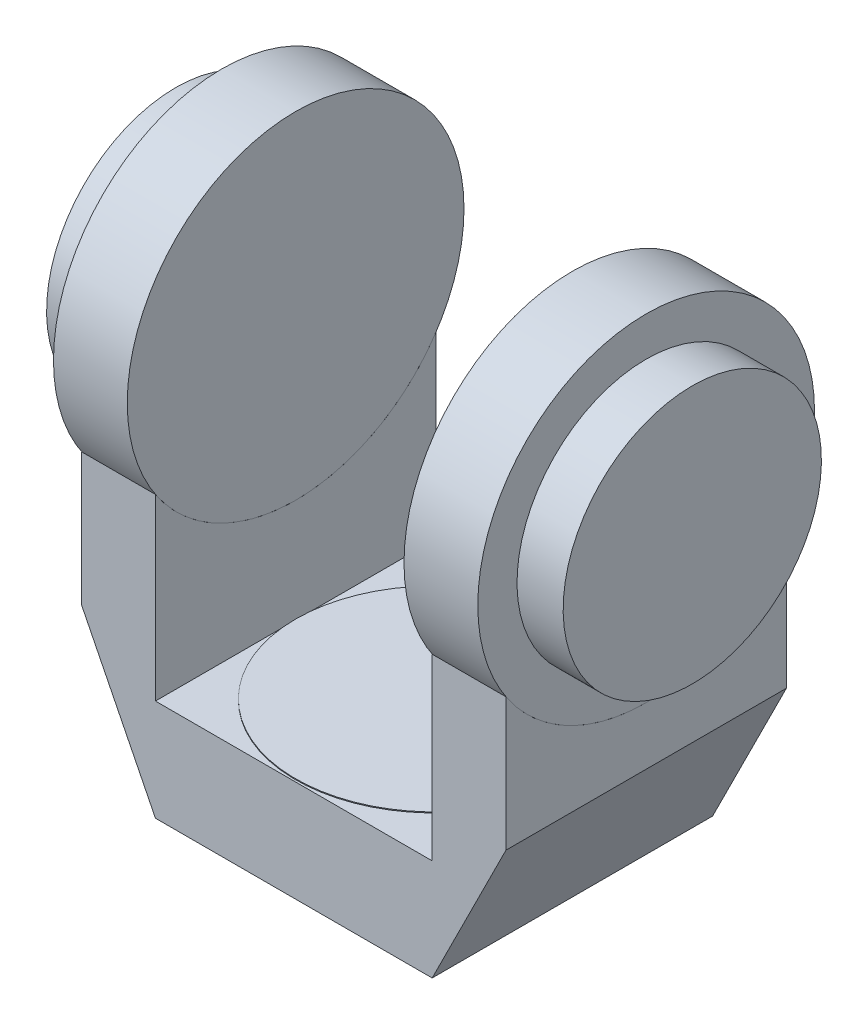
from build123d import *

# Parameters (mm, degrees)
BOSS_EXTRUDE1_DEPTH = 76
CUT_EXTRUDE1_REACH  = 287.972
SKETCH3_R           = 91.26
BOSS_EXTRUDE2_DEPTH = 40
SKETCH4_R           = 70
BOSS_EXTRUDE3_DEPTH = 25
SKETCH5_R           = 75
BOSS_EXTRUDE5_DEPTH = 0.5


with BuildPart() as part:
    # Sketch1 → Boss-Extrude1 (new, symmetric)
    with BuildSketch(Plane.XY):
        Polygon((75, 0), (-75, 0), (-115, 80), (-115, 152), (-75, 152), (-75, 55), (75, 55), (75, 152), (115, 152), (115, 80), align=None)
    extrude(amount=BOSS_EXTRUDE1_DEPTH, both=True)

    # Cut-Extrude1: up to this face of the body (flat: up to its plane)
    cut_extrude1_end = Plane(part.part.faces().sort_by_distance((-115, 116, 0))[0])
    # Sketch2 → Cut-Extrude1 (cut, up to the picked face)
    with BuildSketch(Plane(origin=(115, 0, 0), x_dir=(0, 0, -1), z_dir=(1, 0, 0)), mode=Mode.PRIVATE) as cut_extrude1_sk1:
        with BuildLine():
            Line((-76, 152), (76, 152))
            ThreePointArc((76, 152), (0, 111.257586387), (-76, 152))
        make_face()
    cut_extrude1_tool1 = split(extrude(cut_extrude1_sk1.sketch, amount=-CUT_EXTRUDE1_REACH, mode=Mode.PRIVATE), bisect_by=cut_extrude1_end, keep=Keep.BOTH, mode=Mode.PRIVATE)
    add(cut_extrude1_tool1.solids().sort_by(Axis((115, 135.344431, 0), (-1, 0, 0)))[0], mode=Mode.SUBTRACT)


with BuildPart() as body_2:
    # Sketch3 → Boss-Extrude2 (new body)
    with BuildSketch(Plane.ZY.offset(-75)):
        with Locations((0.004431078, 202.513155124)):
            Circle(SKETCH3_R)
    extrude(amount=-BOSS_EXTRUDE2_DEPTH)


with BuildPart() as body_3:
    # Sketch4 → Boss-Extrude3 (new body)
    with BuildSketch(Plane(origin=(115, 0, 0), x_dir=(0, 0, -1), z_dir=(1, 0, 0))):
        with Locations(Location((-0.004431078, 202.513155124, 0), (0, 0, 90))):
            Circle(SKETCH4_R)
    extrude(amount=BOSS_EXTRUDE3_DEPTH)


with BuildPart() as body_4:
    # Mirror5: mirrored copy
    add(body_3.part.mirror(Plane(origin=(0, 0, 0), x_dir=(0, 0, 1), z_dir=(1, 0, 0))))


with BuildPart() as body_5:
    # Mirror5 2: mirrored copy
    add(body_2.part.mirror(Plane(origin=(0, 0, 0), x_dir=(0, 0, 1), z_dir=(1, 0, 0))))


with BuildPart() as body_6:
    # Sketch5 → Boss-Extrude5 (new body)
    with BuildSketch(Plane(origin=(0, 55, 0), x_dir=(1, 0, 0), z_dir=(0, 1, 0))):
        with Locations(Location((0, 0, 0), (0, 0, 180))):
            Circle(SKETCH5_R)
    extrude(amount=BOSS_EXTRUDE5_DEPTH)


solid = Compound([part.part, body_2.part, body_3.part, body_4.part, body_5.part, body_6.part])
